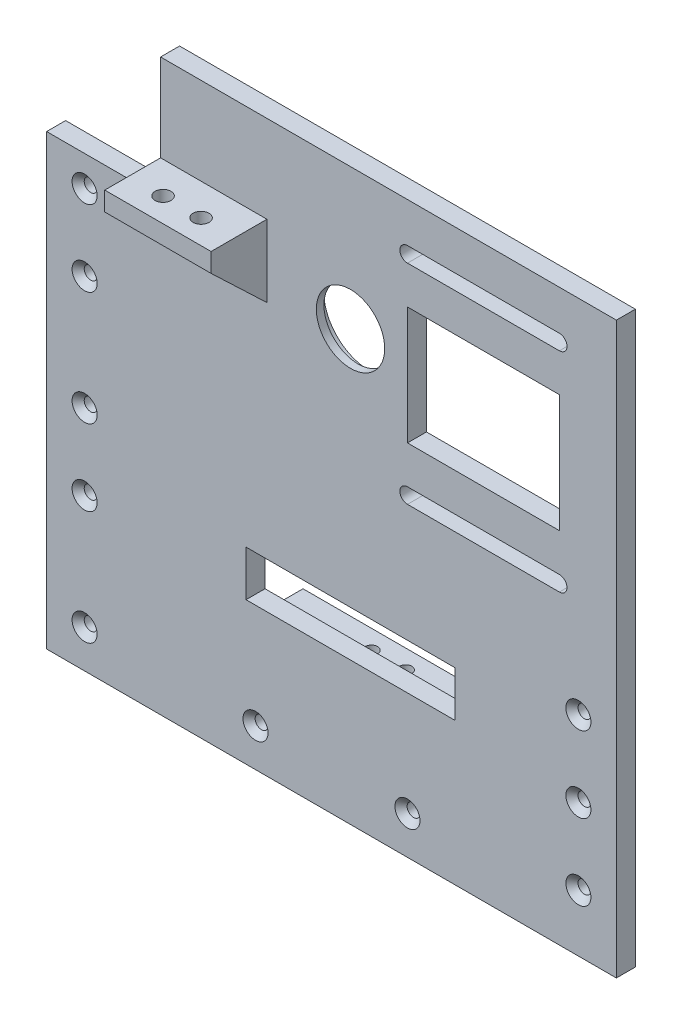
from build123d import *

# Parameters (mm, degrees)
SKETCH_1_W                   = 150
SKETCH_1_H                   = 150
EXTRUDE_1_DEPTH              = 5
HOLE_WIZARD_M3_1_D           = 3.4
HOLE_WIZARD_M3_1_DEPTH       = 11.5
HOLE_WIZARD_M3_1_CSINK_D     = 6.6
HOLE_WIZARD_M3_1_CSINK_ANGLE = 90
HOLE_WIZARD_M3_1_TIP         = 1.021463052
HOLE_WIZARD_M3_2_D           = 3.4
HOLE_WIZARD_M3_2_DEPTH       = 11.5
HOLE_WIZARD_M3_2_CSINK_D     = 6.6
HOLE_WIZARD_M3_2_CSINK_ANGLE = 90
HOLE_WIZARD_M3_2_TIP         = 1.021463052
HOLE_WIZARD_M3_3_D           = 3.4
HOLE_WIZARD_M3_3_DEPTH       = 11.5
HOLE_WIZARD_M3_3_CSINK_D     = 6.6
HOLE_WIZARD_M3_3_CSINK_ANGLE = 90
HOLE_WIZARD_M3_3_TIP         = 1.021463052
SKETCH_8_W                   = 28
SKETCH_8_H                   = 5
EXTRUDE_2_DEPTH              = 14.7
EXTRUDE_3_DEPTH              = 4
EXTRUDE_4_DEPTH              = 4
HOLE_WIZARD_M5_1_AT_2_COUNT  = 2
HOLE_WIZARD_M5_1_AT_2_PITCH  = 10
SKETCH_14_W                  = 30
SKETCH_14_H                  = 32
CUT_EXTRUDE_2_DEPTH          = 10
SKETCH_15_R                  = 9
CUT_EXTRUDE_3_DEPTH          = 10
SKETCH_16_R                  = 12.05
CUT_EXTRUDE_4_DEPTH          = 3
SKETCH_17_W                  = 55
SKETCH_17_H                  = 5
EXTRUDE_5_DEPTH              = 10
EXTRUDE_6_DEPTH              = 5
EXTRUDE_7_DEPTH              = 5
SKETCH_21_W                  = 40
SKETCH_21_H                  = 31
CUT_EXTRUDE_6_DEPTH          = 5
HOLE_WIZARD_M3_4_D           = 3.4
HOLE_WIZARD_M3_4_DEPTH       = 7
HOLE_WIZARD_M3_4_CSINK_D     = 6.6
HOLE_WIZARD_M3_4_CSINK_ANGLE = 90
HOLE_WIZARD_M3_4_TIP         = 1.021463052
SKETCH_26_W                  = 215.985584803
SKETCH_26_H                  = 179.218694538
CUT_EXTRUDE_9_DEPTH          = 14.7
SKETCH_27_W                  = 55
SKETCH_27_H                  = 12
CUT_EXTRUDE_10_DEPTH         = 10
HOLE_WIZARD_M4_1_D           = 3.3
HOLE_WIZARD_M4_1_DEPTH       = 11.5
HOLE_WIZARD_M4_1_TIP         = 0.991420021
SKETCH_30_W                  = 40.51447963
SKETCH_30_H                  = 28.215441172
CUT_EXTRUDE_11_DEPTH         = 14.7
SKETCH_31_W                  = 28
SKETCH_31_H                  = 5
EXTRUDE_8_DEPTH              = 14.7
EXTRUDE_9_DEPTH              = 4
EXTRUDE_10_DEPTH             = 4
HOLE_WIZARD_M5_2_D           = 4.2


with BuildPart() as part:
    # Sketch 1 → Extrude 1 (new body)
    with BuildSketch(Plane.XY):
        Rectangle(SKETCH_1_W, SKETCH_1_H)
    extrude(amount=EXTRUDE_1_DEPTH)

    # Hole Wizard M3 _1
    with Locations(Plane.XY.offset(5)):
        with Locations((-65, -65)):
            CounterSinkHole(HOLE_WIZARD_M3_1_D / 2, HOLE_WIZARD_M3_1_CSINK_D / 2, depth=HOLE_WIZARD_M3_1_DEPTH, counter_sink_angle=HOLE_WIZARD_M3_1_CSINK_ANGLE)
            with Locations((0, 0, -(HOLE_WIZARD_M3_1_DEPTH + HOLE_WIZARD_M3_1_TIP / 2))):  # 118° drill point
                Cone(0, HOLE_WIZARD_M3_1_D / 2, HOLE_WIZARD_M3_1_TIP, mode=Mode.SUBTRACT)

    # Hole Wizard M3 _2
    with Locations(Plane.XY.offset(5)):
        with Locations((-65, 35), (-65, 15), (-65, -15), (-65, -35)):
            CounterSinkHole(HOLE_WIZARD_M3_2_D / 2, HOLE_WIZARD_M3_2_CSINK_D / 2, depth=HOLE_WIZARD_M3_2_DEPTH, counter_sink_angle=HOLE_WIZARD_M3_2_CSINK_ANGLE)
            with Locations((0, 0, -(HOLE_WIZARD_M3_2_DEPTH + HOLE_WIZARD_M3_2_TIP / 2))):  # 118° drill point
                Cone(0, HOLE_WIZARD_M3_2_D / 2, HOLE_WIZARD_M3_2_TIP, mode=Mode.SUBTRACT)

    # Hole Wizard M3 _3
    with Locations(Plane.XY.offset(5)):
        with Locations((-20, -65), (20, -65)):
            CounterSinkHole(HOLE_WIZARD_M3_3_D / 2, HOLE_WIZARD_M3_3_CSINK_D / 2, depth=HOLE_WIZARD_M3_3_DEPTH, counter_sink_angle=HOLE_WIZARD_M3_3_CSINK_ANGLE)
            with Locations((0, 0, -(HOLE_WIZARD_M3_3_DEPTH + HOLE_WIZARD_M3_3_TIP / 2))):  # 118° drill point
                Cone(0, HOLE_WIZARD_M3_3_D / 2, HOLE_WIZARD_M3_3_TIP, mode=Mode.SUBTRACT)

    # Sketch 8 → Extrude 2 (add)
    with BuildSketch(Plane.XY.offset(5)):
        with Locations((-31, 49.5)):
            Rectangle(SKETCH_8_W, SKETCH_8_H)
    extrude_2 = extrude(amount=EXTRUDE_2_DEPTH)

    # Sketch 9 → Extrude 3 (add)
    with BuildSketch(Plane.ZY.offset(45)):
        Polygon((5, 47), (5, 37), (19.7, 47), align=None)
    extrude_3 = extrude(amount=-EXTRUDE_3_DEPTH)

    # Sketch 10 → Extrude 4 (add)
    with BuildSketch(Plane(origin=(-17, 0, 0), x_dir=(0, 0, -1), z_dir=(1, 0, 0))):
        Polygon((-19.7, 47), (-5, 37), (-5, 47), align=None)
    extrude_4 = extrude(amount=-EXTRUDE_4_DEPTH)

    # Sketch 12 → Hole Wizard M5 _1 (revolve, cut)
    with BuildSketch(Plane(origin=(-26, 47, 13.35), x_dir=(0, 0, -1), z_dir=(1, 0, 0))):
        Polygon((0, 0), (0, 15.2618073), (2.1, 14), (2.1, 0), align=None)
    hole_wizard_m5_1 = revolve(axis=Axis((-26, 40.65, 13.35), (0, 1, 0)), mode=Mode.SUBTRACT)

    # Hole Wizard M5 _1 at 2: Hole Wizard M5 _1 ×2
    with Locations(*[(-i * HOLE_WIZARD_M5_1_AT_2_PITCH, 0, 0) for i in range(1, HOLE_WIZARD_M5_1_AT_2_COUNT)]):
        add(hole_wizard_m5_1, mode=Mode.SUBTRACT)

    # Sketch 14 → Cut-Extrude 2 (cut)
    with BuildSketch(Plane.XY.offset(5)):
        with Locations((-60, 59)):
            Rectangle(SKETCH_14_W, SKETCH_14_H)
    extrude(amount=-CUT_EXTRUDE_2_DEPTH, mode=Mode.SUBTRACT)

    # Sketch 15 → Cut-Extrude 3 (cut)
    with BuildSketch(Plane.XY.offset(5)):
        with Locations((5, 38)):
            Circle(SKETCH_15_R)
    extrude(amount=-CUT_EXTRUDE_3_DEPTH, mode=Mode.SUBTRACT)

    # Sketch 16 → Cut-Extrude 4 (cut)
    with BuildSketch(Plane(origin=(0, 0, 0), x_dir=(-1, 0, 0), z_dir=(0, 0, -1))):
        with Locations((-5, 38)):
            Circle(SKETCH_16_R)
    extrude(amount=-CUT_EXTRUDE_4_DEPTH, mode=Mode.SUBTRACT)

    # Sketch 17 → Extrude 5 (add)
    with BuildSketch(Plane.XY.offset(5)):
        with Locations((5, -45)):
            Rectangle(SKETCH_17_W, SKETCH_17_H)
    extrude_5 = extrude(amount=EXTRUDE_5_DEPTH)

    # Sketch 18 → Extrude 6 (add)
    with BuildSketch(Plane.ZY.offset(22.5)):
        Polygon((15, -47.5), (5, -47.5), (5, -57.5), align=None)
    extrude_6 = extrude(amount=-EXTRUDE_6_DEPTH)

    # Sketch 19 → Extrude 7 (add)
    with BuildSketch(Plane(origin=(32.5, 0, 0), x_dir=(0, 0, -1), z_dir=(1, 0, 0))):
        Polygon((-15, -47.5), (-5, -47.5), (-5, -57.5), align=None)
    extrude_7 = extrude(amount=-EXTRUDE_7_DEPTH)

    # Sketch 21 → Cut-Extrude 6 (cut)
    with BuildSketch(Plane.XY.offset(5)):
        with Locations((40, 35)):
            Rectangle(SKETCH_21_W, SKETCH_21_H)
        with BuildLine():
            Line((20, 64.5), (60, 64.5))
            ThreePointArc((60, 64.5), (62, 62.5), (60, 60.5))
            Line((60, 60.5), (20, 60.5))
            ThreePointArc((20, 60.5), (18, 62.5), (20, 64.5))
        make_face()
        with BuildLine():
            Line((20, 9.5), (60, 9.5))
            ThreePointArc((60, 9.5), (62, 7.5), (60, 5.5))
            Line((60, 5.5), (20, 5.5))
            ThreePointArc((20, 5.5), (18, 7.5), (20, 9.5))
        make_face()
    extrude(amount=-CUT_EXTRUDE_6_DEPTH, mode=Mode.SUBTRACT)

    # Hole Wizard M3 _4
    with Locations(Plane.XY.offset(5)):
        with Locations((65, -20), (65, -40), (65, -60)):
            CounterSinkHole(HOLE_WIZARD_M3_4_D / 2, HOLE_WIZARD_M3_4_CSINK_D / 2, depth=HOLE_WIZARD_M3_4_DEPTH, counter_sink_angle=HOLE_WIZARD_M3_4_CSINK_ANGLE)
            with Locations((0, 0, -(HOLE_WIZARD_M3_4_DEPTH + HOLE_WIZARD_M3_4_TIP / 2))):  # 118° drill point
                Cone(0, HOLE_WIZARD_M3_4_D / 2, HOLE_WIZARD_M3_4_TIP, mode=Mode.SUBTRACT)

    # Mirror 1: Extrude 2, Extrude 3, Extrude 4, Hole Wizard M5 _1, Extrude 5, Extrude 6, Extrude 7 across plane
    add(extrude_2.mirror(Plane.XY.offset(2.5)))
    add(extrude_3.mirror(Plane.XY.offset(2.5)))
    add(extrude_4.mirror(Plane.XY.offset(2.5)))
    add(hole_wizard_m5_1.mirror(Plane.XY.offset(2.5)), mode=Mode.SUBTRACT)
    add(extrude_5.mirror(Plane.XY.offset(2.5)))
    add(extrude_6.mirror(Plane.XY.offset(2.5)))
    add(extrude_7.mirror(Plane.XY.offset(2.5)))

    # Mirror 1 copy 1 sketch → Mirror 1 copy 1 (revolve, cut)
    with BuildSketch(Plane(origin=(-36, 47, -8.35), x_dir=(0, 0, 1), z_dir=(1, 0, 0))):
        Polygon((0, 0), (0, -15.2618073), (2.1, -14), (2.1, 0), align=None)
    revolve(axis=Axis((-36, 40.65, -8.35), (0, -1, 0)), mode=Mode.SUBTRACT)

    # Sketch 26 → Cut-Extrude 9 (cut)
    with BuildSketch(Plane.XY.offset(19.7)):
        with Locations((13.290196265, -2.387460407)):
            Rectangle(SKETCH_26_W, SKETCH_26_H)
    extrude(amount=-CUT_EXTRUDE_9_DEPTH, mode=Mode.SUBTRACT)

    # Sketch 27 → Cut-Extrude 10 (cut)
    with BuildSketch(Plane(origin=(0, 0, 0), x_dir=(-1, 0, 0), z_dir=(0, 0, -1))):
        with Locations((-5, -31.5)):
            Rectangle(SKETCH_27_W, SKETCH_27_H)
    extrude(amount=-CUT_EXTRUDE_10_DEPTH, mode=Mode.SUBTRACT)

    # Hole Wizard M4 _1
    with Locations(Plane(origin=(0, -42.5, 0), x_dir=(1, 0, 0), z_dir=(0, 1, 0))):
        with Locations((0.5, 5), (9.5, 5)):
            Hole(HOLE_WIZARD_M4_1_D / 2, depth=HOLE_WIZARD_M4_1_DEPTH)
            with Locations((0, 0, -(HOLE_WIZARD_M4_1_DEPTH + HOLE_WIZARD_M4_1_TIP / 2))):  # 118° drill point
                Cone(0, HOLE_WIZARD_M4_1_D / 2, HOLE_WIZARD_M4_1_TIP, mode=Mode.SUBTRACT)

    # Sketch 30 → Cut-Extrude 11 (cut)
    with BuildSketch(Plane(origin=(0, 0, -14.7), x_dir=(-1, 0, 0), z_dir=(0, 0, -1))):
        with Locations((31.543416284, 47.242777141)):
            Rectangle(SKETCH_30_W, SKETCH_30_H)
    extrude(amount=-CUT_EXTRUDE_11_DEPTH, mode=Mode.SUBTRACT)

    # Sketch 31 → Extrude 8 (add)
    with BuildSketch(Plane.XY.offset(5)):
        with Locations((-31, 49.5)):
            Rectangle(SKETCH_31_W, SKETCH_31_H)
    extrude(amount=EXTRUDE_8_DEPTH)

    # Sketch 32 → Extrude 9 (add)
    with BuildSketch(Plane.ZY.offset(45)):
        Polygon((19.7, 47), (5, 47), (5, 33), align=None)
    extrude(amount=-EXTRUDE_9_DEPTH)

    # Sketch 33 → Extrude 10 (add)
    with BuildSketch(Plane(origin=(-17, 0, 0), x_dir=(0, 0, -1), z_dir=(1, 0, 0))):
        Polygon((-19.7, 47), (-5, 47), (-5, 33), align=None)
    extrude(amount=-EXTRUDE_10_DEPTH)

    # Hole Wizard M5 _2 (through all)
    with Locations(Plane(origin=(0, 52, 0), x_dir=(1, 0, 0), z_dir=(0, 1, 0))):
        with Locations((-36, -13.35), (-26, -13.35)):
            Hole(HOLE_WIZARD_M5_2_D / 2)


solid = part.part
